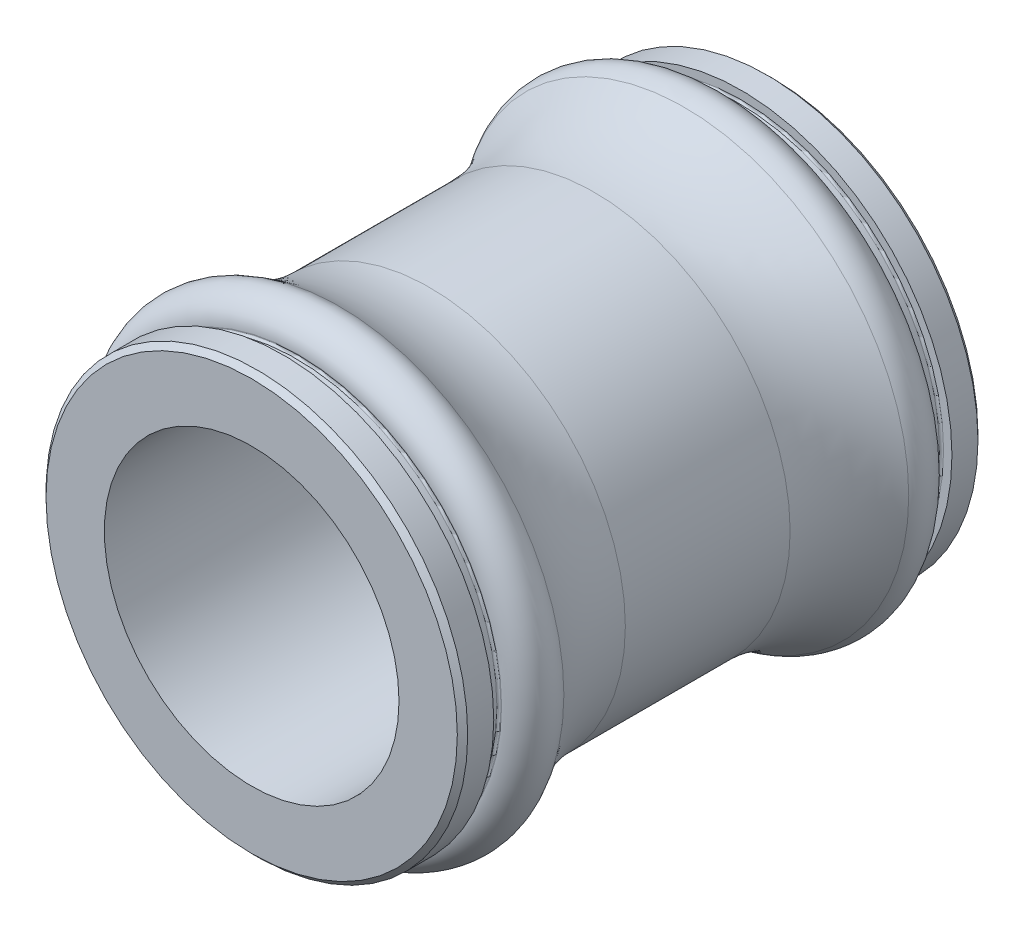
ISO-10303-21;
HEADER;
FILE_DESCRIPTION(('STEP AP214'),'2;1');
FILE_NAME('part.step','',(''),(''),'','','');
FILE_SCHEMA(('AUTOMOTIVE_DESIGN { 1 0 10303 214 1 1 1 1 }'));
ENDSEC;
DATA;
#1=APPLICATION_CONTEXT('core data for automotive mechanical design processes');
#2=APPLICATION_PROTOCOL_DEFINITION('international standard','automotive_design',2000,#1);
#3=PRODUCT_CONTEXT('',#1,'mechanical');
#4=PRODUCT('Part','Part','',(#3));
#5=PRODUCT_RELATED_PRODUCT_CATEGORY('part','',(#4));
#6=PRODUCT_DEFINITION_FORMATION('','',#4);
#7=PRODUCT_DEFINITION_CONTEXT('part definition',#1,'design');
#8=PRODUCT_DEFINITION('design','',#6,#7);
#9=PRODUCT_DEFINITION_SHAPE('','',#8);
#10=(LENGTH_UNIT() NAMED_UNIT(*) SI_UNIT(.MILLI.,.METRE.));
#11=(NAMED_UNIT(*) PLANE_ANGLE_UNIT() SI_UNIT($,.RADIAN.));
#12=(NAMED_UNIT(*) SI_UNIT($,.STERADIAN.) SOLID_ANGLE_UNIT());
#13=UNCERTAINTY_MEASURE_WITH_UNIT(LENGTH_MEASURE(1.E-05),#10,'distance_accuracy_value','');
#14=(GEOMETRIC_REPRESENTATION_CONTEXT(3) GLOBAL_UNCERTAINTY_ASSIGNED_CONTEXT((#13)) GLOBAL_UNIT_ASSIGNED_CONTEXT((#10,
#11,#12)) REPRESENTATION_CONTEXT('',''));
#15=CARTESIAN_POINT('',(0.,0.,0.));
#16=DIRECTION('',(0.,0.,1.));
#17=DIRECTION('',(1.,0.,0.));
#18=AXIS2_PLACEMENT_3D('',#15,#16,#17);
#19=CARTESIAN_POINT('',(0.,19.75,50.));
#20=DIRECTION('',(0.,0.,-1.));
#21=DIRECTION('',(-1.,0.,0.));
#22=AXIS2_PLACEMENT_3D('',#19,#20,#21);
#23=PLANE('',#22);
#24=CARTESIAN_POINT('',(0.,0.,50.));
#25=DIRECTION('',(0.,0.,1.));
#26=DIRECTION('',(1.,0.,0.));
#27=AXIS2_PLACEMENT_3D('',#24,#25,#26);
#28=CIRCLE('',#27,14.15);
#29=CARTESIAN_POINT('',(14.15,0.,50.));
#30=VERTEX_POINT('',#29);
#31=EDGE_CURVE('E103',#30,#30,#28,.T.);
#32=ORIENTED_EDGE('',*,*,#31,.F.);
#33=EDGE_LOOP('',(#32));
#34=FACE_BOUND('',#33,.T.);
#35=CARTESIAN_POINT('',(0.,0.,50.));
#36=DIRECTION('',(0.,0.,1.));
#37=DIRECTION('',(1.,0.,0.));
#38=AXIS2_PLACEMENT_3D('',#35,#36,#37);
#39=CIRCLE('',#38,19.75);
#40=CARTESIAN_POINT('',(19.75,0.,50.));
#41=VERTEX_POINT('',#40);
#42=EDGE_CURVE('E10',#41,#41,#39,.T.);
#43=ORIENTED_EDGE('',*,*,#42,.T.);
#44=EDGE_LOOP('',(#43));
#45=FACE_BOUND('',#44,.T.);
#46=ADVANCED_FACE('F33',(#34,#45),#23,.F.);
#47=CARTESIAN_POINT('',(0.,0.,49.5));
#48=DIRECTION('',(0.,0.,-1.));
#49=DIRECTION('',(-1.,0.,0.));
#50=AXIS2_PLACEMENT_3D('',#47,#48,#49);
#51=CONICAL_SURFACE('',#50,20.25,0.785398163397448);
#52=ORIENTED_EDGE('',*,*,#42,.F.);
#53=EDGE_LOOP('',(#52));
#54=FACE_BOUND('',#53,.T.);
#55=CARTESIAN_POINT('',(0.,0.,49.5));
#56=DIRECTION('',(0.,0.,1.));
#57=DIRECTION('',(1.,0.,0.));
#58=AXIS2_PLACEMENT_3D('',#55,#56,#57);
#59=CIRCLE('',#58,20.25);
#60=CARTESIAN_POINT('',(20.25,0.,49.5));
#61=VERTEX_POINT('',#60);
#62=EDGE_CURVE('E39',#61,#61,#59,.T.);
#63=ORIENTED_EDGE('',*,*,#62,.T.);
#64=EDGE_LOOP('',(#63));
#65=FACE_BOUND('',#64,.T.);
#66=ADVANCED_FACE('F110',(#54,#65),#51,.T.);
#67=CARTESIAN_POINT('',(0.,0.,0.));
#68=DIRECTION('',(0.,0.,1.));
#69=DIRECTION('',(1.,0.,0.));
#70=AXIS2_PLACEMENT_3D('',#67,#68,#69);
#71=CYLINDRICAL_SURFACE('',#70,20.25);
#72=ORIENTED_EDGE('',*,*,#62,.F.);
#73=EDGE_LOOP('',(#72));
#74=FACE_BOUND('',#73,.T.);
#75=CARTESIAN_POINT('',(0.,0.,47.));
#76=DIRECTION('',(0.,0.,1.));
#77=DIRECTION('',(1.,0.,0.));
#78=AXIS2_PLACEMENT_3D('',#75,#76,#77);
#79=CIRCLE('',#78,20.25);
#80=CARTESIAN_POINT('',(20.25,0.,47.));
#81=VERTEX_POINT('',#80);
#82=EDGE_CURVE('E43',#81,#81,#79,.T.);
#83=ORIENTED_EDGE('',*,*,#82,.T.);
#84=EDGE_LOOP('',(#83));
#85=FACE_BOUND('',#84,.T.);
#86=ADVANCED_FACE('F114',(#74,#85),#71,.T.);
#87=CARTESIAN_POINT('',(0.,19.45,47.));
#88=DIRECTION('',(0.,0.,1.));
#89=DIRECTION('',(1.,0.,0.));
#90=AXIS2_PLACEMENT_3D('',#87,#88,#89);
#91=PLANE('',#90);
#92=ORIENTED_EDGE('',*,*,#82,.F.);
#93=EDGE_LOOP('',(#92));
#94=FACE_BOUND('',#93,.T.);
#95=CARTESIAN_POINT('',(0.,0.,47.));
#96=DIRECTION('',(0.,0.,1.));
#97=DIRECTION('',(1.,0.,0.));
#98=AXIS2_PLACEMENT_3D('',#95,#96,#97);
#99=CIRCLE('',#98,19.45);
#100=CARTESIAN_POINT('',(19.45,0.,47.));
#101=VERTEX_POINT('',#100);
#102=EDGE_CURVE('E47',#101,#101,#99,.T.);
#103=ORIENTED_EDGE('',*,*,#102,.T.);
#104=EDGE_LOOP('',(#103));
#105=FACE_BOUND('',#104,.T.);
#106=ADVANCED_FACE('F119',(#94,#105),#91,.F.);
#107=CARTESIAN_POINT('',(0.,0.,46.8));
#108=DIRECTION('',(0.,0.,1.));
#109=DIRECTION('',(1.,0.,0.));
#110=AXIS2_PLACEMENT_3D('',#107,#108,#109);
#111=TOROIDAL_SURFACE('',#110,19.45,0.200000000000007);
#112=ORIENTED_EDGE('',*,*,#102,.F.);
#113=EDGE_LOOP('',(#112));
#114=FACE_BOUND('',#113,.T.);
#115=CARTESIAN_POINT('',(0.,0.,46.8));
#116=DIRECTION('',(0.,0.,1.));
#117=DIRECTION('',(1.,0.,0.));
#118=AXIS2_PLACEMENT_3D('',#115,#116,#117);
#119=CIRCLE('',#118,19.25);
#120=CARTESIAN_POINT('',(19.25,0.,46.8));
#121=VERTEX_POINT('',#120);
#122=EDGE_CURVE('E52',#121,#121,#119,.T.);
#123=ORIENTED_EDGE('',*,*,#122,.T.);
#124=EDGE_LOOP('',(#123));
#125=FACE_BOUND('',#124,.T.);
#126=ADVANCED_FACE('F125',(#114,#125),#111,.F.);
#127=CARTESIAN_POINT('',(0.,0.,0.));
#128=DIRECTION('',(0.,0.,1.));
#129=DIRECTION('',(1.,0.,0.));
#130=AXIS2_PLACEMENT_3D('',#127,#128,#129);
#131=CYLINDRICAL_SURFACE('',#130,19.25);
#132=ORIENTED_EDGE('',*,*,#122,.F.);
#133=EDGE_LOOP('',(#132));
#134=FACE_BOUND('',#133,.T.);
#135=CARTESIAN_POINT('',(0.,0.,45.7));
#136=DIRECTION('',(0.,0.,1.));
#137=DIRECTION('',(1.,0.,0.));
#138=AXIS2_PLACEMENT_3D('',#135,#136,#137);
#139=CIRCLE('',#138,19.25);
#140=CARTESIAN_POINT('',(19.25,0.,45.7));
#141=VERTEX_POINT('',#140);
#142=EDGE_CURVE('E55',#141,#141,#139,.T.);
#143=ORIENTED_EDGE('',*,*,#142,.T.);
#144=EDGE_LOOP('',(#143));
#145=FACE_BOUND('',#144,.T.);
#146=ADVANCED_FACE('F129',(#134,#145),#131,.T.);
#147=CARTESIAN_POINT('',(0.,0.,45.7));
#148=DIRECTION('',(0.,0.,1.));
#149=DIRECTION('',(1.,0.,0.));
#150=AXIS2_PLACEMENT_3D('',#147,#148,#149);
#151=TOROIDAL_SURFACE('',#150,19.45,0.200000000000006);
#152=ORIENTED_EDGE('',*,*,#142,.F.);
#153=EDGE_LOOP('',(#152));
#154=FACE_BOUND('',#153,.T.);
#155=CARTESIAN_POINT('',(0.,0.,45.5));
#156=DIRECTION('',(0.,0.,1.));
#157=DIRECTION('',(1.,0.,0.));
#158=AXIS2_PLACEMENT_3D('',#155,#156,#157);
#159=CIRCLE('',#158,19.45);
#160=CARTESIAN_POINT('',(19.45,0.,45.5));
#161=VERTEX_POINT('',#160);
#162=EDGE_CURVE('E58',#161,#161,#159,.T.);
#163=ORIENTED_EDGE('',*,*,#162,.T.);
#164=EDGE_LOOP('',(#163));
#165=FACE_BOUND('',#164,.T.);
#166=ADVANCED_FACE('F133',(#154,#165),#151,.F.);
#167=CARTESIAN_POINT('',(0.,19.5,45.5));
#168=DIRECTION('',(0.,0.,-1.));
#169=DIRECTION('',(-1.,0.,0.));
#170=AXIS2_PLACEMENT_3D('',#167,#168,#169);
#171=PLANE('',#170);
#172=ORIENTED_EDGE('',*,*,#162,.F.);
#173=EDGE_LOOP('',(#172));
#174=FACE_BOUND('',#173,.T.);
#175=CARTESIAN_POINT('',(0.,0.,45.5));
#176=DIRECTION('',(0.,0.,1.));
#177=DIRECTION('',(1.,0.,0.));
#178=AXIS2_PLACEMENT_3D('',#175,#176,#177);
#179=CIRCLE('',#178,19.5);
#180=CARTESIAN_POINT('',(19.5,0.,45.5));
#181=VERTEX_POINT('',#180);
#182=EDGE_CURVE('E61',#181,#181,#179,.T.);
#183=ORIENTED_EDGE('',*,*,#182,.T.);
#184=EDGE_LOOP('',(#183));
#185=FACE_BOUND('',#184,.T.);
#186=ADVANCED_FACE('F137',(#174,#185),#171,.F.);
#187=CARTESIAN_POINT('',(0.,0.,43.));
#188=DIRECTION('',(0.,0.,1.));
#189=DIRECTION('',(1.,0.,0.));
#190=AXIS2_PLACEMENT_3D('',#187,#188,#189);
#191=TOROIDAL_SURFACE('',#190,19.5,2.5);
#192=ORIENTED_EDGE('',*,*,#182,.F.);
#193=EDGE_LOOP('',(#192));
#194=FACE_BOUND('',#193,.T.);
#195=CARTESIAN_POINT('',(0.,0.,41.5589119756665));
#196=DIRECTION('',(0.,0.,1.));
#197=DIRECTION('',(1.,0.,0.));
#198=AXIS2_PLACEMENT_3D('',#195,#196,#197);
#199=CIRCLE('',#198,21.5428571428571);
#200=CARTESIAN_POINT('',(21.5428571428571,0.,41.5589119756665));
#201=VERTEX_POINT('',#200);
#202=EDGE_CURVE('E64',#201,#201,#199,.T.);
#203=ORIENTED_EDGE('',*,*,#202,.T.);
#204=EDGE_LOOP('',(#203));
#205=FACE_BOUND('',#204,.T.);
#206=ADVANCED_FACE('F141',(#194,#205),#191,.T.);
#207=CARTESIAN_POINT('',(0.,0.,32.9123838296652));
#208=DIRECTION('',(0.,0.,1.));
#209=DIRECTION('',(1.,0.,0.));
#210=AXIS2_PLACEMENT_3D('',#207,#208,#209);
#211=TOROIDAL_SURFACE('',#210,33.8000000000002,15.0000000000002);
#212=ORIENTED_EDGE('',*,*,#202,.F.);
#213=EDGE_LOOP('',(#212));
#214=FACE_BOUND('',#213,.T.);
#215=CARTESIAN_POINT('',(0.,0.,32.9123838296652));
#216=DIRECTION('',(0.,0.,1.));
#217=DIRECTION('',(1.,0.,0.));
#218=AXIS2_PLACEMENT_3D('',#215,#216,#217);
#219=CIRCLE('',#218,18.8);
#220=CARTESIAN_POINT('',(18.8,0.,32.9123838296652));
#221=VERTEX_POINT('',#220);
#222=EDGE_CURVE('E67',#221,#221,#219,.T.);
#223=ORIENTED_EDGE('',*,*,#222,.T.);
#224=EDGE_LOOP('',(#223));
#225=FACE_BOUND('',#224,.T.);
#226=ADVANCED_FACE('F145',(#214,#225),#211,.F.);
#227=CARTESIAN_POINT('',(0.,0.,0.));
#228=DIRECTION('',(0.,0.,1.));
#229=DIRECTION('',(1.,0.,0.));
#230=AXIS2_PLACEMENT_3D('',#227,#228,#229);
#231=CYLINDRICAL_SURFACE('',#230,18.8);
#232=ORIENTED_EDGE('',*,*,#222,.F.);
#233=EDGE_LOOP('',(#232));
#234=FACE_BOUND('',#233,.T.);
#235=CARTESIAN_POINT('',(0.,0.,17.0876161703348));
#236=DIRECTION('',(0.,0.,1.));
#237=DIRECTION('',(1.,0.,0.));
#238=AXIS2_PLACEMENT_3D('',#235,#236,#237);
#239=CIRCLE('',#238,18.8);
#240=CARTESIAN_POINT('',(18.8,0.,17.0876161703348));
#241=VERTEX_POINT('',#240);
#242=EDGE_CURVE('E70',#241,#241,#239,.T.);
#243=ORIENTED_EDGE('',*,*,#242,.T.);
#244=EDGE_LOOP('',(#243));
#245=FACE_BOUND('',#244,.T.);
#246=ADVANCED_FACE('F149',(#234,#245),#231,.T.);
#247=CARTESIAN_POINT('',(0.,0.,17.0876161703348));
#248=DIRECTION('',(0.,0.,1.));
#249=DIRECTION('',(1.,0.,0.));
#250=AXIS2_PLACEMENT_3D('',#247,#248,#249);
#251=TOROIDAL_SURFACE('',#250,33.7999999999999,14.9999999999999);
#252=ORIENTED_EDGE('',*,*,#242,.F.);
#253=EDGE_LOOP('',(#252));
#254=FACE_BOUND('',#253,.T.);
#255=CARTESIAN_POINT('',(0.,0.,8.44108802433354));
#256=DIRECTION('',(0.,0.,1.));
#257=DIRECTION('',(1.,0.,0.));
#258=AXIS2_PLACEMENT_3D('',#255,#256,#257);
#259=CIRCLE('',#258,21.5428571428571);
#260=CARTESIAN_POINT('',(21.5428571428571,0.,8.44108802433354));
#261=VERTEX_POINT('',#260);
#262=EDGE_CURVE('E73',#261,#261,#259,.T.);
#263=ORIENTED_EDGE('',*,*,#262,.T.);
#264=EDGE_LOOP('',(#263));
#265=FACE_BOUND('',#264,.T.);
#266=ADVANCED_FACE('F153',(#254,#265),#251,.F.);
#267=CARTESIAN_POINT('',(0.,0.,7.));
#268=DIRECTION('',(0.,0.,1.));
#269=DIRECTION('',(1.,0.,0.));
#270=AXIS2_PLACEMENT_3D('',#267,#268,#269);
#271=TOROIDAL_SURFACE('',#270,19.5,2.5);
#272=ORIENTED_EDGE('',*,*,#262,.F.);
#273=EDGE_LOOP('',(#272));
#274=FACE_BOUND('',#273,.T.);
#275=CARTESIAN_POINT('',(0.,0.,4.5));
#276=DIRECTION('',(0.,0.,1.));
#277=DIRECTION('',(1.,0.,0.));
#278=AXIS2_PLACEMENT_3D('',#275,#276,#277);
#279=CIRCLE('',#278,19.5);
#280=CARTESIAN_POINT('',(19.5,0.,4.5));
#281=VERTEX_POINT('',#280);
#282=EDGE_CURVE('E76',#281,#281,#279,.T.);
#283=ORIENTED_EDGE('',*,*,#282,.T.);
#284=EDGE_LOOP('',(#283));
#285=FACE_BOUND('',#284,.T.);
#286=ADVANCED_FACE('F157',(#274,#285),#271,.T.);
#287=CARTESIAN_POINT('',(0.,19.45,4.5));
#288=DIRECTION('',(0.,0.,1.));
#289=DIRECTION('',(1.,0.,0.));
#290=AXIS2_PLACEMENT_3D('',#287,#288,#289);
#291=PLANE('',#290);
#292=ORIENTED_EDGE('',*,*,#282,.F.);
#293=EDGE_LOOP('',(#292));
#294=FACE_BOUND('',#293,.T.);
#295=CARTESIAN_POINT('',(0.,0.,4.5));
#296=DIRECTION('',(0.,0.,1.));
#297=DIRECTION('',(1.,0.,0.));
#298=AXIS2_PLACEMENT_3D('',#295,#296,#297);
#299=CIRCLE('',#298,19.45);
#300=CARTESIAN_POINT('',(19.45,0.,4.5));
#301=VERTEX_POINT('',#300);
#302=EDGE_CURVE('E79',#301,#301,#299,.T.);
#303=ORIENTED_EDGE('',*,*,#302,.T.);
#304=EDGE_LOOP('',(#303));
#305=FACE_BOUND('',#304,.T.);
#306=ADVANCED_FACE('F161',(#294,#305),#291,.F.);
#307=CARTESIAN_POINT('',(0.,0.,4.3));
#308=DIRECTION('',(0.,0.,1.));
#309=DIRECTION('',(1.,0.,0.));
#310=AXIS2_PLACEMENT_3D('',#307,#308,#309);
#311=TOROIDAL_SURFACE('',#310,19.45,0.200000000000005);
#312=ORIENTED_EDGE('',*,*,#302,.F.);
#313=EDGE_LOOP('',(#312));
#314=FACE_BOUND('',#313,.T.);
#315=CARTESIAN_POINT('',(0.,0.,4.3));
#316=DIRECTION('',(0.,0.,1.));
#317=DIRECTION('',(1.,0.,0.));
#318=AXIS2_PLACEMENT_3D('',#315,#316,#317);
#319=CIRCLE('',#318,19.25);
#320=CARTESIAN_POINT('',(19.25,0.,4.3));
#321=VERTEX_POINT('',#320);
#322=EDGE_CURVE('E82',#321,#321,#319,.T.);
#323=ORIENTED_EDGE('',*,*,#322,.T.);
#324=EDGE_LOOP('',(#323));
#325=FACE_BOUND('',#324,.T.);
#326=ADVANCED_FACE('F165',(#314,#325),#311,.F.);
#327=CARTESIAN_POINT('',(0.,0.,0.));
#328=DIRECTION('',(0.,0.,1.));
#329=DIRECTION('',(1.,0.,0.));
#330=AXIS2_PLACEMENT_3D('',#327,#328,#329);
#331=CYLINDRICAL_SURFACE('',#330,19.25);
#332=ORIENTED_EDGE('',*,*,#322,.F.);
#333=EDGE_LOOP('',(#332));
#334=FACE_BOUND('',#333,.T.);
#335=CARTESIAN_POINT('',(0.,0.,3.2));
#336=DIRECTION('',(0.,0.,1.));
#337=DIRECTION('',(1.,0.,0.));
#338=AXIS2_PLACEMENT_3D('',#335,#336,#337);
#339=CIRCLE('',#338,19.25);
#340=CARTESIAN_POINT('',(19.25,0.,3.2));
#341=VERTEX_POINT('',#340);
#342=EDGE_CURVE('E85',#341,#341,#339,.T.);
#343=ORIENTED_EDGE('',*,*,#342,.T.);
#344=EDGE_LOOP('',(#343));
#345=FACE_BOUND('',#344,.T.);
#346=ADVANCED_FACE('F169',(#334,#345),#331,.T.);
#347=CARTESIAN_POINT('',(0.,0.,3.2));
#348=DIRECTION('',(0.,0.,1.));
#349=DIRECTION('',(1.,0.,0.));
#350=AXIS2_PLACEMENT_3D('',#347,#348,#349);
#351=TOROIDAL_SURFACE('',#350,19.45,0.200000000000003);
#352=ORIENTED_EDGE('',*,*,#342,.F.);
#353=EDGE_LOOP('',(#352));
#354=FACE_BOUND('',#353,.T.);
#355=CARTESIAN_POINT('',(0.,0.,3.));
#356=DIRECTION('',(0.,0.,1.));
#357=DIRECTION('',(1.,0.,0.));
#358=AXIS2_PLACEMENT_3D('',#355,#356,#357);
#359=CIRCLE('',#358,19.45);
#360=CARTESIAN_POINT('',(19.45,0.,3.));
#361=VERTEX_POINT('',#360);
#362=EDGE_CURVE('E88',#361,#361,#359,.T.);
#363=ORIENTED_EDGE('',*,*,#362,.T.);
#364=EDGE_LOOP('',(#363));
#365=FACE_BOUND('',#364,.T.);
#366=ADVANCED_FACE('F173',(#354,#365),#351,.F.);
#367=CARTESIAN_POINT('',(0.,20.25,3.));
#368=DIRECTION('',(0.,0.,-1.));
#369=DIRECTION('',(-1.,0.,0.));
#370=AXIS2_PLACEMENT_3D('',#367,#368,#369);
#371=PLANE('',#370);
#372=ORIENTED_EDGE('',*,*,#362,.F.);
#373=EDGE_LOOP('',(#372));
#374=FACE_BOUND('',#373,.T.);
#375=CARTESIAN_POINT('',(0.,0.,3.));
#376=DIRECTION('',(0.,0.,1.));
#377=DIRECTION('',(1.,0.,0.));
#378=AXIS2_PLACEMENT_3D('',#375,#376,#377);
#379=CIRCLE('',#378,20.25);
#380=CARTESIAN_POINT('',(20.25,0.,3.));
#381=VERTEX_POINT('',#380);
#382=EDGE_CURVE('E91',#381,#381,#379,.T.);
#383=ORIENTED_EDGE('',*,*,#382,.T.);
#384=EDGE_LOOP('',(#383));
#385=FACE_BOUND('',#384,.T.);
#386=ADVANCED_FACE('F177',(#374,#385),#371,.F.);
#387=CARTESIAN_POINT('',(0.,0.,0.));
#388=DIRECTION('',(0.,0.,1.));
#389=DIRECTION('',(1.,0.,0.));
#390=AXIS2_PLACEMENT_3D('',#387,#388,#389);
#391=CYLINDRICAL_SURFACE('',#390,20.25);
#392=ORIENTED_EDGE('',*,*,#382,.F.);
#393=EDGE_LOOP('',(#392));
#394=FACE_BOUND('',#393,.T.);
#395=CARTESIAN_POINT('',(0.,0.,0.5));
#396=DIRECTION('',(0.,0.,1.));
#397=DIRECTION('',(1.,0.,0.));
#398=AXIS2_PLACEMENT_3D('',#395,#396,#397);
#399=CIRCLE('',#398,20.25);
#400=CARTESIAN_POINT('',(20.25,0.,0.5));
#401=VERTEX_POINT('',#400);
#402=EDGE_CURVE('E94',#401,#401,#399,.T.);
#403=ORIENTED_EDGE('',*,*,#402,.T.);
#404=EDGE_LOOP('',(#403));
#405=FACE_BOUND('',#404,.T.);
#406=ADVANCED_FACE('F181',(#394,#405),#391,.T.);
#407=CARTESIAN_POINT('',(0.,0.,0.));
#408=DIRECTION('',(0.,0.,1.));
#409=DIRECTION('',(1.,0.,0.));
#410=AXIS2_PLACEMENT_3D('',#407,#408,#409);
#411=CONICAL_SURFACE('',#410,19.75,0.785398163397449);
#412=ORIENTED_EDGE('',*,*,#402,.F.);
#413=EDGE_LOOP('',(#412));
#414=FACE_BOUND('',#413,.T.);
#415=CARTESIAN_POINT('',(0.,0.,0.));
#416=DIRECTION('',(0.,0.,1.));
#417=DIRECTION('',(1.,0.,0.));
#418=AXIS2_PLACEMENT_3D('',#415,#416,#417);
#419=CIRCLE('',#418,19.75);
#420=CARTESIAN_POINT('',(19.75,0.,0.));
#421=VERTEX_POINT('',#420);
#422=EDGE_CURVE('E97',#421,#421,#419,.T.);
#423=ORIENTED_EDGE('',*,*,#422,.T.);
#424=EDGE_LOOP('',(#423));
#425=FACE_BOUND('',#424,.T.);
#426=ADVANCED_FACE('F185',(#414,#425),#411,.T.);
#427=CARTESIAN_POINT('',(0.,14.15,0.));
#428=DIRECTION('',(0.,0.,1.));
#429=DIRECTION('',(1.,0.,0.));
#430=AXIS2_PLACEMENT_3D('',#427,#428,#429);
#431=PLANE('',#430);
#432=ORIENTED_EDGE('',*,*,#422,.F.);
#433=EDGE_LOOP('',(#432));
#434=FACE_BOUND('',#433,.T.);
#435=CARTESIAN_POINT('',(0.,0.,0.));
#436=DIRECTION('',(0.,0.,1.));
#437=DIRECTION('',(1.,0.,0.));
#438=AXIS2_PLACEMENT_3D('',#435,#436,#437);
#439=CIRCLE('',#438,14.15);
#440=CARTESIAN_POINT('',(14.15,0.,0.));
#441=VERTEX_POINT('',#440);
#442=EDGE_CURVE('E100',#441,#441,#439,.T.);
#443=ORIENTED_EDGE('',*,*,#442,.T.);
#444=EDGE_LOOP('',(#443));
#445=FACE_BOUND('',#444,.T.);
#446=ADVANCED_FACE('F189',(#434,#445),#431,.F.);
#447=CARTESIAN_POINT('',(0.,0.,0.));
#448=DIRECTION('',(0.,0.,1.));
#449=DIRECTION('',(1.,0.,0.));
#450=AXIS2_PLACEMENT_3D('',#447,#448,#449);
#451=CYLINDRICAL_SURFACE('',#450,14.15);
#452=ORIENTED_EDGE('',*,*,#442,.F.);
#453=EDGE_LOOP('',(#452));
#454=FACE_BOUND('',#453,.T.);
#455=ORIENTED_EDGE('',*,*,#31,.T.);
#456=EDGE_LOOP('',(#455));
#457=FACE_BOUND('',#456,.T.);
#458=ADVANCED_FACE('F107',(#454,#457),#451,.F.);
#459=CLOSED_SHELL('',(#46,#66,#86,#106,#126,#146,#166,#186,#206,#226,#246,#266,#286,#306,#326,
#346,#366,#386,#406,#426,#446,#458));
#460=MANIFOLD_SOLID_BREP('B2',#459);
#461=ADVANCED_BREP_SHAPE_REPRESENTATION('',(#18,#460),#14);
#462=SHAPE_DEFINITION_REPRESENTATION(#9,#461);
ENDSEC;
END-ISO-10303-21;
